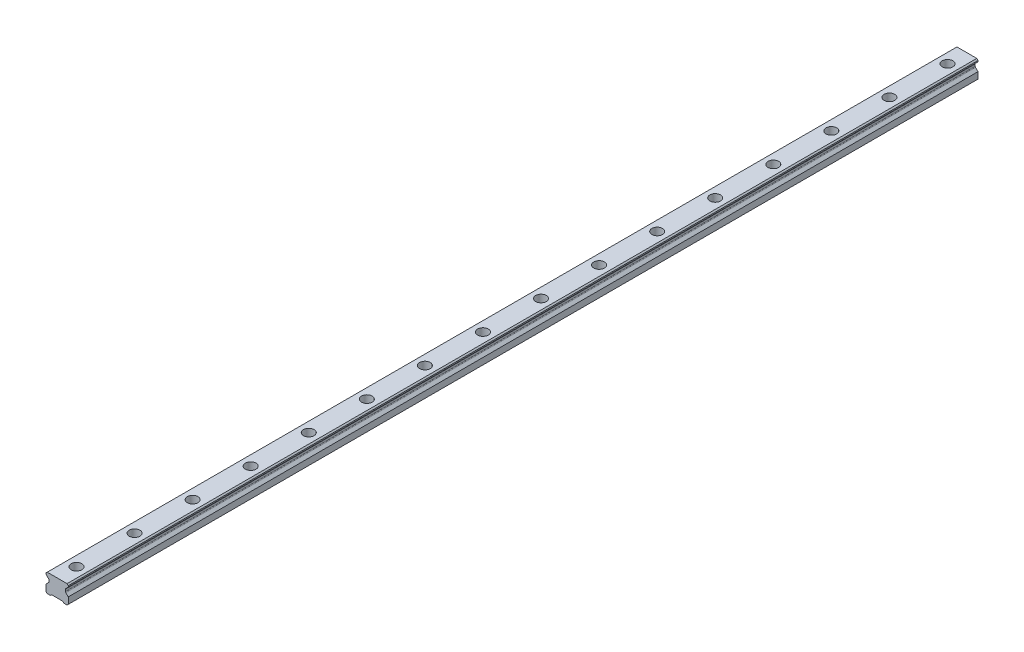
from build123d import *

# Parameters (mm, degrees)
SKETCH1_W           = 23
SKETCH1_H           = 19.2
BOSS_EXTRUDE1_DEPTH = 470
CUT_EXTRUDE1_DEPTH  = 941.266393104
CHAMFER1_SIZE       = 1.25
FILLET1_R           = 1.25
CUT_EXTRUDE2_DEPTH  = 941.266393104
SKETCH4_R           = 5.5
SKETCH4_R_2         = 3.5
CUT_EXTRUDE3_DEPTH  = 9
SKETCH4_2_R         = 3.5
CUT_EXTRUDE4_DEPTH  = 471.532559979
LPATTERN1_COUNT     = 16
LPATTERN1_PITCH     = 60


with BuildPart() as part:
    # Sketch1 → Boss-Extrude1 (new, symmetric)
    with BuildSketch(Plane.XY):
        with Locations((0, 9.6)):
            Rectangle(SKETCH1_W, SKETCH1_H)
    extrude(amount=BOSS_EXTRUDE1_DEPTH, both=True)

    # Sketch2 → Cut-Extrude1 (cut, through all)
    with BuildSketch(Plane.XY.offset(470)):
        Polygon((-11.5, 16.7), (-11.5, 7.95), (-8.583333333, 10.866666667), (-8.583333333, 13.783333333), align=None)
        Polygon((8.583333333, 13.783333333), (11.5, 16.7), (11.5, 7.95), (8.583333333, 10.866666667), align=None)
    extrude(amount=-CUT_EXTRUDE1_DEPTH, mode=Mode.SUBTRACT)

    # Chamfer1
    chamfer1_edges = [part.edges().sort_by_distance(p)[0] for p in [
        (-11.5, 19.2, 0),
        (11.5, 19.2, 0),
        (11.5, 0, 0),
        (-11.5, 0, 0),
    ]]
    chamfer(chamfer1_edges, length=CHAMFER1_SIZE)

    # Fillet1
    fillet1_edges = [part.edges().sort_by_distance(p)[0] for p in [
        (-8.583333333, 13.783333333, 0),
        (-8.583333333, 10.866666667, 0),
        (8.583333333, 10.866666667, 0),
        (8.583333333, 13.783333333, 0),
    ]]
    fillet(fillet1_edges, radius=FILLET1_R)

    # Sketch3 → Cut-Extrude2 (cut, through all)
    with BuildSketch(Plane.XY.offset(470)):
        Polygon((-7, 0), (-5.75, 1.25), (5.75, 1.25), (7, 0), align=None)
    extrude(amount=-CUT_EXTRUDE2_DEPTH, mode=Mode.SUBTRACT)

    # Sketch4 → Cut-Extrude3 (cut)
    with BuildSketch(Plane(origin=(0, 19.2, 0), x_dir=(1, 0, 0), z_dir=(0, 1, 0))):
        with Locations(Location((0, -450, 0), (0, 0, 270))):
            Circle(SKETCH4_R)
        with Locations(Location((0, -450, 0), (0, 0, 270))):
            Circle(SKETCH4_R_2, mode=Mode.SUBTRACT)
    cut_extrude3 = extrude(amount=-CUT_EXTRUDE3_DEPTH, mode=Mode.SUBTRACT)

    # Sketch4_2 → Cut-Extrude4 (cut, through all)
    with BuildSketch(Plane(origin=(0, 19.2, 0), x_dir=(1, 0, 0), z_dir=(0, 1, 0))):
        with Locations(Location((0, -450, 0), (0, 0, 270))):
            Circle(SKETCH4_2_R)
    cut_extrude4 = extrude(amount=-CUT_EXTRUDE4_DEPTH, mode=Mode.SUBTRACT)

    # LPattern1: Cut-Extrude3, Cut-Extrude4 ×16
    with Locations(*[(0, 0, -i * LPATTERN1_PITCH) for i in range(1, LPATTERN1_COUNT)]):
        add(cut_extrude3, mode=Mode.SUBTRACT)
        add(cut_extrude4, mode=Mode.SUBTRACT)


solid = part.part
